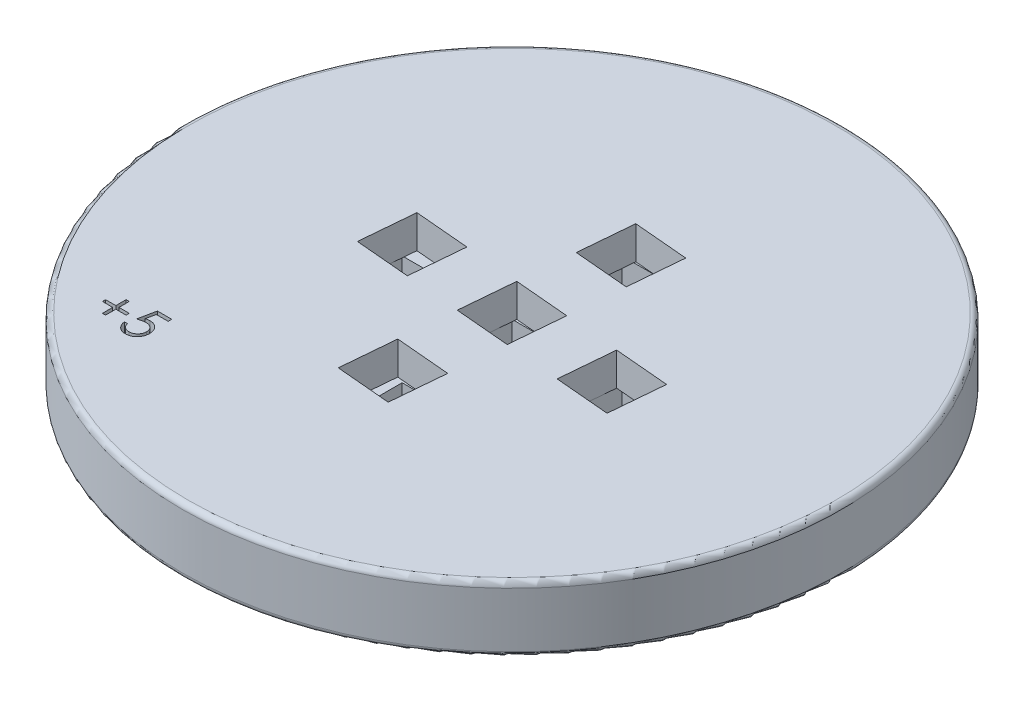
from build123d import *

# Parameters (mm, degrees)
SKETCH1_R           = 30
BOSS_EXTRUDE1_DEPTH = 6
SKETCH4_W           = 5
SKETCH4_H           = 5
CUT_EXTRUDE2_DEPTH  = 3
FILLET2_R           = 0.5
FILLET3_R           = 0.5
CUT_EXTRUDE3_DEPTH  = 3


with BuildPart() as part:
    # Sketch1 → Boss-Extrude1 (new body)
    with BuildSketch(Plane(origin=(0, 0, 0), x_dir=(1, 0, 0), z_dir=(0, 1, 0))):
        with Locations(Location((0, 0, 0), (0, 0, 270))):
            Circle(SKETCH1_R)
    extrude(amount=BOSS_EXTRUDE1_DEPTH)

    # Sketch4 → Cut-Extrude2 (cut)
    with BuildSketch(Plane(origin=(0, 0, 0), x_dir=(-1, 0, 0), z_dir=(0, -1, 0))):
        Rectangle(SKETCH4_W, SKETCH4_H)
        with Locations((0, -10)):
            Rectangle(SKETCH4_W, SKETCH4_H)
        with Locations((10, 0)):
            Rectangle(SKETCH4_W, SKETCH4_H)
        with Locations((-10, 0)):
            Rectangle(SKETCH4_W, SKETCH4_H)
        with Locations((0, 10)):
            Rectangle(SKETCH4_W, SKETCH4_H)
    extrude(amount=-CUT_EXTRUDE2_DEPTH, mode=Mode.SUBTRACT)

    # Fillet2
    fillet2_edges = [part.edges().sort_by_distance(p)[0] for p in [
        (0, 0, -30),
        (-2.5, 0, 10),
        (0, 0, 7.5),
        (2.5, 0, 10),
        (0, 0, 12.5),
        (-12.5, 0, 0),
        (-10, 0, -2.5),
        (-7.5, 0, 0),
        (-10, 0, 2.5),
        (7.5, 0, 0),
        (10, 0, -2.5),
        (12.5, 0, 0),
        (10, 0, 2.5),
        (2.5, 0, -10),
        (0, 0, -7.5),
        (-2.5, 0, -10),
        (0, 0, -12.5),
        (-2.5, 0, 0),
        (0, 0, -2.5),
        (2.5, 0, 0),
        (0, 0, 2.5),
    ]]
    fillet(fillet2_edges, radius=FILLET2_R)

    # Fillet3
    fillet3_edges = [part.edges().sort_by_distance(p)[0] for p in [
        (0, 6, -30),
    ]]
    fillet(fillet3_edges, radius=FILLET3_R)

    # Sketch6 → Cut-Extrude3 (cut)
    with BuildSketch(Plane(origin=(0, 6, 0), x_dir=(1, 0, 0), z_dir=(0, 1, 0))):
        Polygon((-2.708376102, -2.272597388), (2.272597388, -2.708376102), (2.708376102, 2.272597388), (-2.272597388, 2.708376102), align=None)
        Polygon((-1.836818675, 7.689349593), (3.144154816, 7.253570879), (3.57993353, 12.234544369), (-1.401039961, 12.670323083), align=None)
        Polygon((1.401039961, -12.670323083), (-3.57993353, -12.234544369), (-3.144154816, -7.253570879), (1.836818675, -7.689349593), align=None)
        Polygon((12.234544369, -3.57993353), (7.253570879, -3.144154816), (7.689349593, 1.836818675), (12.670323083, 1.401039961), align=None)
        Polygon((-12.670323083, -1.401039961), (-7.689349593, -1.836818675), (-7.253570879, 3.144154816), (-12.234544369, 3.57993353), align=None)
        Polygon((-18.612018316, -17.45125776), (-18.612018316, -16.515039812), (-18.327082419, -16.515039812), (-18.327082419, -17.45125776), (-17.39086447, -17.45125776), (-17.39086447, -17.736193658), (-18.327082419, -17.736193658), (-18.327082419, -18.672411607), (-18.612018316, -18.672411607), (-18.612018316, -17.736193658), (-19.548236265, -17.736193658), (-19.548236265, -17.45125776), align=None)
        with BuildLine():
            Line((-14.989261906, -15.985873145), (-14.989261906, -16.311514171))
            Line((-14.989261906, -16.311514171), (-16.069219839, -16.311514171))
            Line((-16.069219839, -16.311514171), (-16.240308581, -17.146605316))
            add(Edge.make_bspline(
                [(-16.240308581, -17.146605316), (-16.206693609, -17.137324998), (-16.141569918, -17.11934585), (-16.045449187, -17.099383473), (-15.954197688, -17.08734982), (-15.894983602, -17.085706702), (-15.866330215, -17.084911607)],
                knots=[0, 0, 0, 0, 1.100273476, 2.13160584, 3.095893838, 4, 4, 4, 4], degree=3))
            add(Edge.make_bspline(
                [(-15.866330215, -17.084911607), (-15.83087568, -17.085678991), (-15.761163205, -17.087187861), (-15.659165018, -17.10167661), (-15.56179875, -17.124482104), (-15.469268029, -17.156341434), (-15.381401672, -17.197080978), (-15.299008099, -17.247971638), (-15.220850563, -17.307419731), (-15.14833121, -17.375768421), (-15.082541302, -17.450990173), (-15.02469644, -17.531869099), (-14.975563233, -17.617619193), (-14.936047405, -17.709059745), (-14.904493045, -17.805179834), (-14.883490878, -17.90699082), (-14.869505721, -18.013533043), (-14.86794327, -18.08638076), (-14.867146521, -18.123528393)],
                knots=[0, 0, 0, 0, 1.052922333, 2.070308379, 3.05430497, 4.020497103, 4.973039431, 5.925935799, 6.892292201, 7.88610001, 8.88166317, 9.857072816, 10.836096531, 11.812156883, 12.81219415, 13.836441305, 14.89672472, 16, 16, 16, 16], degree=3))
            add(Edge.make_bspline(
                [(-14.867146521, -18.123528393), (-14.86774984, -18.149402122), (-14.868948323, -18.200799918), (-14.875043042, -18.277130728), (-14.886777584, -18.351845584), (-14.902532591, -18.424954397), (-14.922981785, -18.496318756), (-14.947736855, -18.566142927), (-14.978031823, -18.633992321), (-15.011261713, -18.700508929), (-15.048678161, -18.764189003), (-15.090205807, -18.823742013), (-15.134080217, -18.880061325), (-15.181289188, -18.932542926), (-15.232271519, -18.980841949), (-15.286409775, -19.025245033), (-15.343271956, -19.066503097), (-15.403737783, -19.102941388), (-15.466459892, -19.13647207), (-15.532344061, -19.16397985), (-15.599890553, -19.188572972), (-15.670071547, -19.208175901), (-15.742728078, -19.223536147), (-15.81797991, -19.233968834), (-15.895432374, -19.24156746), (-15.947933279, -19.242043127), (-15.974453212, -19.242283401)],
                knots=[0, 0, 0, 0, 1.056347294, 2.098418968, 3.122841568, 4.141288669, 5.149314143, 6.15115421, 7.162517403, 8.180376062, 9.185164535, 10.17417709, 11.141909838, 12.097768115, 13.052685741, 14.0056014, 14.954263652, 15.917497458, 16.885230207, 17.854509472, 18.828990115, 19.81800267, 20.826176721, 21.857883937, 22.917946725, 24, 24, 24, 24], degree=3))
            add(Edge.make_bspline(
                [(-15.974453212, -19.242283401), (-16.006089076, -19.241656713), (-16.068328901, -19.240423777), (-16.159515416, -19.227525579), (-16.247249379, -19.209052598), (-16.330824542, -19.181261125), (-16.410989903, -19.146438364), (-16.486666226, -19.102427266), (-16.55978718, -19.052553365), (-16.627380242, -18.993697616), (-16.690114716, -18.929366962), (-16.746272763, -18.859555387), (-16.796286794, -18.785415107), (-16.839355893, -18.706586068), (-16.876093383, -18.6232754), (-16.904954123, -18.535170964), (-16.928248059, -18.442733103), (-16.938102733, -18.379093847), (-16.94310806, -18.346770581)],
                knots=[0, 0, 0, 0, 1.0467383, 2.05933395, 3.04377827, 4.011590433, 4.970194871, 5.932262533, 6.905835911, 7.896367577, 8.894135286, 9.877477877, 10.858688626, 11.851381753, 12.8477658, 13.868841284, 14.917554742, 16, 16, 16, 16], degree=3))
            Line((-16.94310806, -18.346770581), (-16.658172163, -18.346770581))
            add(Edge.make_bspline(
                [(-16.658172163, -18.346770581), (-16.651161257, -18.377047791), (-16.637685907, -18.435242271), (-16.608107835, -18.517004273), (-16.571943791, -18.589865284), (-16.528941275, -18.65478912), (-16.477642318, -18.711402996), (-16.419104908, -18.761855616), (-16.353475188, -18.807371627), (-16.280547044, -18.845310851), (-16.203609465, -18.877667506), (-16.123084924, -18.899213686), (-16.041165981, -18.914363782), (-15.985759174, -18.915880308), (-15.957916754, -18.916642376)],
                knots=[0, 0, 0, 0, 1.136247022, 2.183929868, 3.172523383, 4.106158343, 5.02341133, 5.958108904, 6.928429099, 7.938127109, 8.96079061, 9.975095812, 10.982467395, 12, 12, 12, 12], degree=3))
            add(Edge.make_bspline(
                [(-15.957916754, -18.916642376), (-15.930740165, -18.915897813), (-15.877229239, -18.914431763), (-15.79847891, -18.903147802), (-15.72244866, -18.885769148), (-15.6498887, -18.859761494), (-15.579529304, -18.828152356), (-15.51315024, -18.787589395), (-15.448831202, -18.740907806), (-15.388571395, -18.687425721), (-15.333381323, -18.628488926), (-15.284616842, -18.565463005), (-15.243997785, -18.498228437), (-15.209767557, -18.42794922), (-15.183774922, -18.3538551), (-15.165232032, -18.27629332), (-15.154343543, -18.195072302), (-15.152845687, -18.139673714), (-15.152082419, -18.111444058)],
                knots=[0, 0, 0, 0, 1.027316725, 2.022795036, 3.002884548, 3.971462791, 4.93288096, 5.914575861, 6.907176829, 7.935150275, 8.956128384, 9.956726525, 10.942570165, 11.921478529, 12.907843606, 13.90538589, 14.932640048, 16, 16, 16, 16], degree=3))
            add(Edge.make_bspline(
                [(-15.152082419, -18.111444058), (-15.152679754, -18.085975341), (-15.153848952, -18.03612395), (-15.163401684, -17.963190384), (-15.180017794, -17.894181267), (-15.203080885, -17.828763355), (-15.23236301, -17.766874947), (-15.268146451, -17.708452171), (-15.311102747, -17.65426505), (-15.360171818, -17.604288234), (-15.413927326, -17.558164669), (-15.47329415, -17.518845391), (-15.537029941, -17.485767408), (-15.604366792, -17.457221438), (-15.676906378, -17.436719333), (-15.75321218, -17.421327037), (-15.834108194, -17.412423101), (-15.889417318, -17.411187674), (-15.917847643, -17.410552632)],
                knots=[0, 0, 0, 0, 1.045622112, 2.046656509, 3.013763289, 3.955457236, 4.890082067, 5.820317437, 6.762574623, 7.722996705, 8.69280354, 9.665887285, 10.63943826, 11.638615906, 12.663482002, 13.728887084, 14.832589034, 16, 16, 16, 16], degree=3))
            add(Edge.make_bspline(
                [(-15.917847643, -17.410552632), (-15.942457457, -17.411079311), (-15.99327048, -17.41216677), (-16.071214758, -17.420173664), (-16.15312225, -17.433090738), (-16.238678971, -17.450858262), (-16.32814186, -17.474109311), (-16.421322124, -17.50197175), (-16.51841568, -17.535283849), (-16.583836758, -17.560440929), (-16.617467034, -17.573373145)],
                knots=[0, 0, 0, 0, 0.817624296, 1.688186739, 2.600797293, 3.572016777, 4.590301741, 5.671205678, 6.80286297, 8, 8, 8, 8], degree=3))
            Line((-16.617467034, -17.573373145), (-16.291826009, -15.985873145))
            Line((-16.291826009, -15.985873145), (-14.989261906, -15.985873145))
        make_face()
    extrude(amount=-CUT_EXTRUDE3_DEPTH, mode=Mode.SUBTRACT)


solid = part.part
